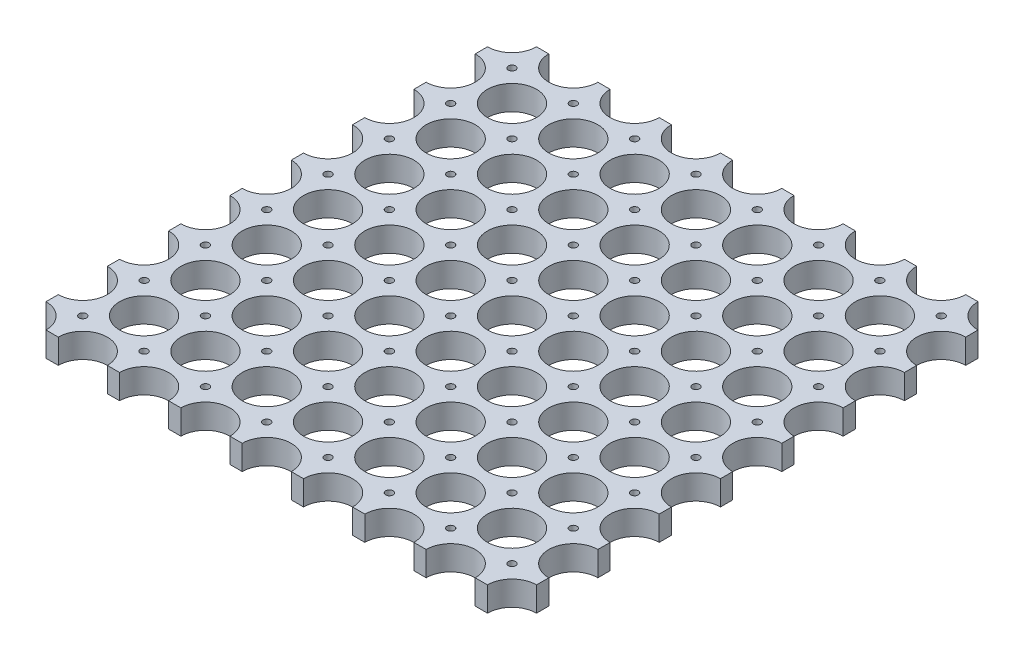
from build123d import *

# Parameters (mm, degrees)
SKETCH1_W           = 100
SKETCH1_H           = 100
BOSS_EXTRUDE1_DEPTH = 5
SKETCH3_R           = 5
CUT_EXTRUDE1_DEPTH  = 5
SKETCH4_R           = 0.75
CUT_EXTRUDE2_DEPTH  = 5


with BuildPart() as part:
    # Sketch1 → Boss-Extrude1 (new body)
    with BuildSketch(Plane(origin=(0, 0, 0), x_dir=(1, 0, 0), z_dir=(0, 1, 0))):
        Rectangle(SKETCH1_W, SKETCH1_H)
    extrude(amount=BOSS_EXTRUDE1_DEPTH)

    # Sketch3 → Cut-Extrude1 (cut)
    with BuildSketch(Plane.XZ):
        with Locations((-50, 50)):
            Circle(SKETCH3_R)
        with Locations((-37.5, 50)):
            Circle(SKETCH3_R)
        with Locations((-25, 50)):
            Circle(SKETCH3_R)
        with Locations((-12.5, 50)):
            Circle(SKETCH3_R)
        with Locations((0, 50)):
            Circle(SKETCH3_R)
        with Locations((12.5, 50)):
            Circle(SKETCH3_R)
        with Locations((25, 50)):
            Circle(SKETCH3_R)
        with Locations((37.5, 50)):
            Circle(SKETCH3_R)
        with Locations((50, 50)):
            Circle(SKETCH3_R)
        with Locations((-50, 37.5)):
            Circle(SKETCH3_R)
        with Locations(Location((-37.5, 37.5, 0), (0, 0, 270))):
            Circle(SKETCH3_R)
        with Locations(Location((-25, 37.5, 0), (0, 0, 270))):
            Circle(SKETCH3_R)
        with Locations(Location((-12.5, 37.5, 0), (0, 0, 270))):
            Circle(SKETCH3_R)
        with Locations(Location((0, 37.5, 0), (0, 0, 270))):
            Circle(SKETCH3_R)
        with Locations(Location((12.5, 37.5, 0), (0, 0, 270))):
            Circle(SKETCH3_R)
        with Locations(Location((25, 37.5, 0), (0, 0, 270))):
            Circle(SKETCH3_R)
        with Locations(Location((37.5, 37.5, 0), (0, 0, 270))):
            Circle(SKETCH3_R)
        with Locations((50, 37.5)):
            Circle(SKETCH3_R)
        with Locations((-50, 25)):
            Circle(SKETCH3_R)
        with Locations(Location((-37.5, 25, 0), (0, 0, 270))):
            Circle(SKETCH3_R)
        with Locations(Location((-25, 25, 0), (0, 0, 270))):
            Circle(SKETCH3_R)
        with Locations(Location((-12.5, 25, 0), (0, 0, 270))):
            Circle(SKETCH3_R)
        with Locations(Location((0, 25, 0), (0, 0, 270))):
            Circle(SKETCH3_R)
        with Locations(Location((12.5, 25, 0), (0, 0, 270))):
            Circle(SKETCH3_R)
        with Locations(Location((25, 25, 0), (0, 0, 270))):
            Circle(SKETCH3_R)
        with Locations(Location((37.5, 25, 0), (0, 0, 270))):
            Circle(SKETCH3_R)
        with Locations((50, 25)):
            Circle(SKETCH3_R)
        with Locations((-50, 12.5)):
            Circle(SKETCH3_R)
        with Locations(Location((-37.5, 12.5, 0), (0, 0, 270))):
            Circle(SKETCH3_R)
        with Locations(Location((-25, 12.5, 0), (0, 0, 270))):
            Circle(SKETCH3_R)
        with Locations(Location((-12.5, 12.5, 0), (0, 0, 270))):
            Circle(SKETCH3_R)
        with Locations(Location((0, 12.5, 0), (0, 0, 270))):
            Circle(SKETCH3_R)
        with Locations(Location((12.5, 12.5, 0), (0, 0, 270))):
            Circle(SKETCH3_R)
        with Locations(Location((25, 12.5, 0), (0, 0, 270))):
            Circle(SKETCH3_R)
        with Locations(Location((37.5, 12.5, 0), (0, 0, 270))):
            Circle(SKETCH3_R)
        with Locations((50, 12.5)):
            Circle(SKETCH3_R)
        with Locations((-50, 0)):
            Circle(SKETCH3_R)
        with Locations(Location((-37.5, 0, 0), (0, 0, 270))):
            Circle(SKETCH3_R)
        with Locations(Location((-25, 0, 0), (0, 0, 270))):
            Circle(SKETCH3_R)
        with Locations(Location((-12.5, 0, 0), (0, 0, 270))):
            Circle(SKETCH3_R)
        with Locations(Location((0, 0, 0), (0, 0, 270))):
            Circle(SKETCH3_R)
        with Locations(Location((12.5, 0, 0), (0, 0, 270))):
            Circle(SKETCH3_R)
        with Locations(Location((25, 0, 0), (0, 0, 270))):
            Circle(SKETCH3_R)
        with Locations(Location((37.5, 0, 0), (0, 0, 270))):
            Circle(SKETCH3_R)
        with Locations((50, 0)):
            Circle(SKETCH3_R)
        with Locations((-50, -12.5)):
            Circle(SKETCH3_R)
        with Locations(Location((-37.5, -12.5, 0), (0, 0, 270))):
            Circle(SKETCH3_R)
        with Locations(Location((-25, -12.5, 0), (0, 0, 270))):
            Circle(SKETCH3_R)
        with Locations(Location((-12.5, -12.5, 0), (0, 0, 270))):
            Circle(SKETCH3_R)
        with Locations(Location((0, -12.5, 0), (0, 0, 270))):
            Circle(SKETCH3_R)
        with Locations(Location((12.5, -12.5, 0), (0, 0, 270))):
            Circle(SKETCH3_R)
        with Locations(Location((25, -12.5, 0), (0, 0, 270))):
            Circle(SKETCH3_R)
        with Locations(Location((37.5, -12.5, 0), (0, 0, 270))):
            Circle(SKETCH3_R)
        with Locations((50, -12.5)):
            Circle(SKETCH3_R)
        with Locations((-50, -25)):
            Circle(SKETCH3_R)
        with Locations(Location((-37.5, -25, 0), (0, 0, 270))):
            Circle(SKETCH3_R)
        with Locations(Location((-25, -25, 0), (0, 0, 270))):
            Circle(SKETCH3_R)
        with Locations(Location((-12.5, -25, 0), (0, 0, 270))):
            Circle(SKETCH3_R)
        with Locations(Location((0, -25, 0), (0, 0, 270))):
            Circle(SKETCH3_R)
        with Locations(Location((12.5, -25, 0), (0, 0, 270))):
            Circle(SKETCH3_R)
        with Locations(Location((25, -25, 0), (0, 0, 270))):
            Circle(SKETCH3_R)
        with Locations(Location((37.5, -25, 0), (0, 0, 270))):
            Circle(SKETCH3_R)
        with Locations((50, -25)):
            Circle(SKETCH3_R)
        with Locations((-50, -37.5)):
            Circle(SKETCH3_R)
        with Locations(Location((-37.5, -37.5, 0), (0, 0, 270))):
            Circle(SKETCH3_R)
        with Locations(Location((-25, -37.5, 0), (0, 0, 270))):
            Circle(SKETCH3_R)
        with Locations(Location((-12.5, -37.5, 0), (0, 0, 270))):
            Circle(SKETCH3_R)
        with Locations(Location((0, -37.5, 0), (0, 0, 270))):
            Circle(SKETCH3_R)
        with Locations(Location((12.5, -37.5, 0), (0, 0, 270))):
            Circle(SKETCH3_R)
        with Locations(Location((25, -37.5, 0), (0, 0, 270))):
            Circle(SKETCH3_R)
        with Locations(Location((37.5, -37.5, 0), (0, 0, 270))):
            Circle(SKETCH3_R)
        with Locations((50, -37.5)):
            Circle(SKETCH3_R)
        with Locations((-50, -50)):
            Circle(SKETCH3_R)
        with Locations((-37.5, -50)):
            Circle(SKETCH3_R)
        with Locations((-25, -50)):
            Circle(SKETCH3_R)
        with Locations((-12.5, -50)):
            Circle(SKETCH3_R)
        with Locations((0, -50)):
            Circle(SKETCH3_R)
        with Locations((12.5, -50)):
            Circle(SKETCH3_R)
        with Locations((25, -50)):
            Circle(SKETCH3_R)
        with Locations((37.5, -50)):
            Circle(SKETCH3_R)
        with Locations((50, -50)):
            Circle(SKETCH3_R)
    extrude(amount=-CUT_EXTRUDE1_DEPTH, mode=Mode.SUBTRACT)

    # Sketch4 → Cut-Extrude2 (cut)
    with BuildSketch(Plane(origin=(0, 0, 0), x_dir=(1, 0, 0), z_dir=(0, 1, 0))):
        with Locations(Location((-43.75, -43.75, 0), (0, 0, 270))):
            Circle(SKETCH4_R)
        with Locations(Location((-31.25, -43.75, 0), (0, 0, 270))):
            Circle(SKETCH4_R)
        with Locations(Location((-18.75, -43.75, 0), (0, 0, 270))):
            Circle(SKETCH4_R)
        with Locations(Location((-6.25, -43.75, 0), (0, 0, 270))):
            Circle(SKETCH4_R)
        with Locations(Location((6.25, -43.75, 0), (0, 0, 270))):
            Circle(SKETCH4_R)
        with Locations(Location((18.75, -43.75, 0), (0, 0, 270))):
            Circle(SKETCH4_R)
        with Locations(Location((31.25, -43.75, 0), (0, 0, 270))):
            Circle(SKETCH4_R)
        with Locations(Location((43.75, -43.75, 0), (0, 0, 270))):
            Circle(SKETCH4_R)
        with Locations(Location((-43.75, -31.25, 0), (0, 0, 270))):
            Circle(SKETCH4_R)
        with Locations(Location((-31.25, -31.25, 0), (0, 0, 270))):
            Circle(SKETCH4_R)
        with Locations(Location((-18.75, -31.25, 0), (0, 0, 270))):
            Circle(SKETCH4_R)
        with Locations(Location((-6.25, -31.25, 0), (0, 0, 270))):
            Circle(SKETCH4_R)
        with Locations(Location((6.25, -31.25, 0), (0, 0, 270))):
            Circle(SKETCH4_R)
        with Locations(Location((18.75, -31.25, 0), (0, 0, 270))):
            Circle(SKETCH4_R)
        with Locations(Location((31.25, -31.25, 0), (0, 0, 270))):
            Circle(SKETCH4_R)
        with Locations(Location((43.75, -31.25, 0), (0, 0, 270))):
            Circle(SKETCH4_R)
        with Locations(Location((-43.75, -18.75, 0), (0, 0, 270))):
            Circle(SKETCH4_R)
        with Locations(Location((-31.25, -18.75, 0), (0, 0, 270))):
            Circle(SKETCH4_R)
        with Locations(Location((-18.75, -18.75, 0), (0, 0, 270))):
            Circle(SKETCH4_R)
        with Locations(Location((-6.25, -18.75, 0), (0, 0, 270))):
            Circle(SKETCH4_R)
        with Locations(Location((6.25, -18.75, 0), (0, 0, 270))):
            Circle(SKETCH4_R)
        with Locations(Location((18.75, -18.75, 0), (0, 0, 270))):
            Circle(SKETCH4_R)
        with Locations(Location((31.25, -18.75, 0), (0, 0, 270))):
            Circle(SKETCH4_R)
        with Locations(Location((43.75, -18.75, 0), (0, 0, 270))):
            Circle(SKETCH4_R)
        with Locations(Location((-43.75, -6.25, 0), (0, 0, 270))):
            Circle(SKETCH4_R)
        with Locations(Location((-31.25, -6.25, 0), (0, 0, 270))):
            Circle(SKETCH4_R)
        with Locations(Location((-18.75, -6.25, 0), (0, 0, 270))):
            Circle(SKETCH4_R)
        with Locations(Location((-6.25, -6.25, 0), (0, 0, 270))):
            Circle(SKETCH4_R)
        with Locations(Location((6.25, -6.25, 0), (0, 0, 270))):
            Circle(SKETCH4_R)
        with Locations(Location((18.75, -6.25, 0), (0, 0, 270))):
            Circle(SKETCH4_R)
        with Locations(Location((31.25, -6.25, 0), (0, 0, 270))):
            Circle(SKETCH4_R)
        with Locations(Location((43.75, -6.25, 0), (0, 0, 270))):
            Circle(SKETCH4_R)
        with Locations(Location((-43.75, 6.25, 0), (0, 0, 270))):
            Circle(SKETCH4_R)
        with Locations(Location((-31.25, 6.25, 0), (0, 0, 270))):
            Circle(SKETCH4_R)
        with Locations(Location((-18.75, 6.25, 0), (0, 0, 270))):
            Circle(SKETCH4_R)
        with Locations(Location((-6.25, 6.25, 0), (0, 0, 270))):
            Circle(SKETCH4_R)
        with Locations(Location((6.25, 6.25, 0), (0, 0, 270))):
            Circle(SKETCH4_R)
        with Locations(Location((18.75, 6.25, 0), (0, 0, 270))):
            Circle(SKETCH4_R)
        with Locations(Location((31.25, 6.25, 0), (0, 0, 270))):
            Circle(SKETCH4_R)
        with Locations(Location((43.75, 6.25, 0), (0, 0, 270))):
            Circle(SKETCH4_R)
        with Locations(Location((-43.75, 18.75, 0), (0, 0, 270))):
            Circle(SKETCH4_R)
        with Locations(Location((-31.25, 18.75, 0), (0, 0, 270))):
            Circle(SKETCH4_R)
        with Locations(Location((-18.75, 18.75, 0), (0, 0, 270))):
            Circle(SKETCH4_R)
        with Locations(Location((-6.25, 18.75, 0), (0, 0, 270))):
            Circle(SKETCH4_R)
        with Locations(Location((6.25, 18.75, 0), (0, 0, 270))):
            Circle(SKETCH4_R)
        with Locations(Location((18.75, 18.75, 0), (0, 0, 270))):
            Circle(SKETCH4_R)
        with Locations(Location((31.25, 18.75, 0), (0, 0, 270))):
            Circle(SKETCH4_R)
        with Locations(Location((43.75, 18.75, 0), (0, 0, 270))):
            Circle(SKETCH4_R)
        with Locations(Location((-43.75, 31.25, 0), (0, 0, 270))):
            Circle(SKETCH4_R)
        with Locations(Location((-31.25, 31.25, 0), (0, 0, 270))):
            Circle(SKETCH4_R)
        with Locations(Location((-18.75, 31.25, 0), (0, 0, 270))):
            Circle(SKETCH4_R)
        with Locations(Location((-6.25, 31.25, 0), (0, 0, 270))):
            Circle(SKETCH4_R)
        with Locations(Location((6.25, 31.25, 0), (0, 0, 270))):
            Circle(SKETCH4_R)
        with Locations(Location((18.75, 31.25, 0), (0, 0, 270))):
            Circle(SKETCH4_R)
        with Locations(Location((31.25, 31.25, 0), (0, 0, 270))):
            Circle(SKETCH4_R)
        with Locations(Location((43.75, 31.25, 0), (0, 0, 270))):
            Circle(SKETCH4_R)
        with Locations(Location((-43.75, 43.75, 0), (0, 0, 270))):
            Circle(SKETCH4_R)
        with Locations(Location((-31.25, 43.75, 0), (0, 0, 270))):
            Circle(SKETCH4_R)
        with Locations(Location((-18.75, 43.75, 0), (0, 0, 270))):
            Circle(SKETCH4_R)
        with Locations(Location((-6.25, 43.75, 0), (0, 0, 270))):
            Circle(SKETCH4_R)
        with Locations(Location((6.25, 43.75, 0), (0, 0, 270))):
            Circle(SKETCH4_R)
        with Locations(Location((18.75, 43.75, 0), (0, 0, 270))):
            Circle(SKETCH4_R)
        with Locations(Location((31.25, 43.75, 0), (0, 0, 270))):
            Circle(SKETCH4_R)
        with Locations(Location((43.75, 43.75, 0), (0, 0, 270))):
            Circle(SKETCH4_R)
    extrude(amount=CUT_EXTRUDE2_DEPTH, mode=Mode.SUBTRACT)


solid = part.part
